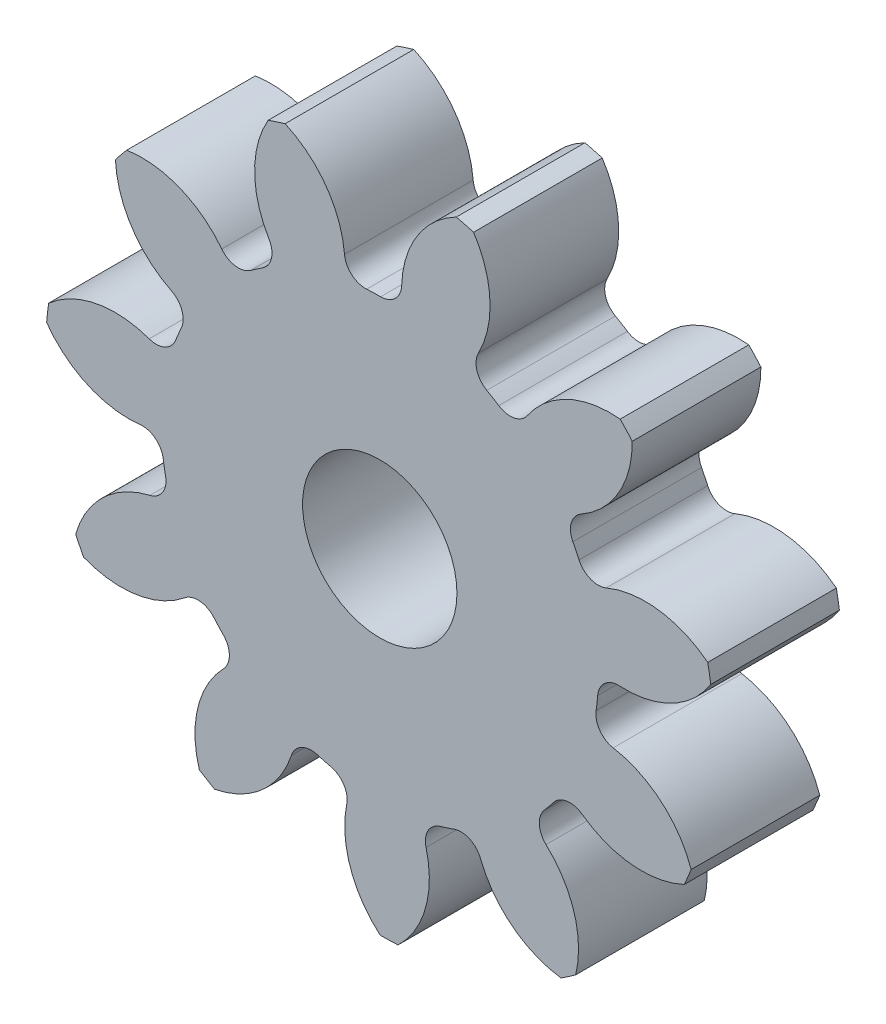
from build123d import *

# Parameters (mm, degrees)
SKETCH3_R         = 330.2
GEARBODY_DEPTH    = 127
TOOTHCUT_DEPTH    = 484.934995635
CIRPATTERN1_COUNT = 11
BOREDIA_R         = 76.2
BORE_DEPTH        = 12700


with BuildPart() as part:
    # Sketch3 → gearBody (new body)
    with BuildSketch(Plane.XY):
        Circle(SKETCH3_R)
    extrude(amount=GEARBODY_DEPTH)

    # Sketch2 → toothCut (cut, through all)
    with BuildSketch(Plane.XY):
        with BuildLine():
            ThreePointArc((213.573587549, -31.60906043), (214.478301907, -24.735965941), (215.161888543, -17.837368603))
            ThreePointArc((215.161888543, -17.837368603), (222.199784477, -3.94375042), (236.935994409, 1.096956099))
            ThreePointArc((236.935994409, 1.096956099), (291.164894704, 13.609233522), (330.2, 53.277750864))
            ThreePointArc((330.2, 53.277750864), (332.268081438, -38.320761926), (309.403366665, -127.043754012))
            ThreePointArc((309.403366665, -127.043754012), (280.422957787, -79.530949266), (230.465958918, -55.002823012))
            ThreePointArc((230.465958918, -55.002823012), (217.264057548, -46.739990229), (213.573587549, -31.60906043))
        make_face()
    toothcut = extrude(amount=TOOTHCUT_DEPTH, mode=Mode.SUBTRACT)

    # CirPattern1: toothCut ×11 about axis
    cirpattern1_axis = Axis((0, 0, 0), (0, 0, 1))
    for i in range(1, CIRPATTERN1_COUNT):
        add(toothcut.rotate(cirpattern1_axis, i * 360 / CIRPATTERN1_COUNT), mode=Mode.SUBTRACT)

    # boreDia → bore (cut, symmetric)
    with BuildSketch(Plane.XY):
        Circle(BOREDIA_R)
    extrude(amount=BORE_DEPTH, both=True, mode=Mode.SUBTRACT)


solid = part.part
